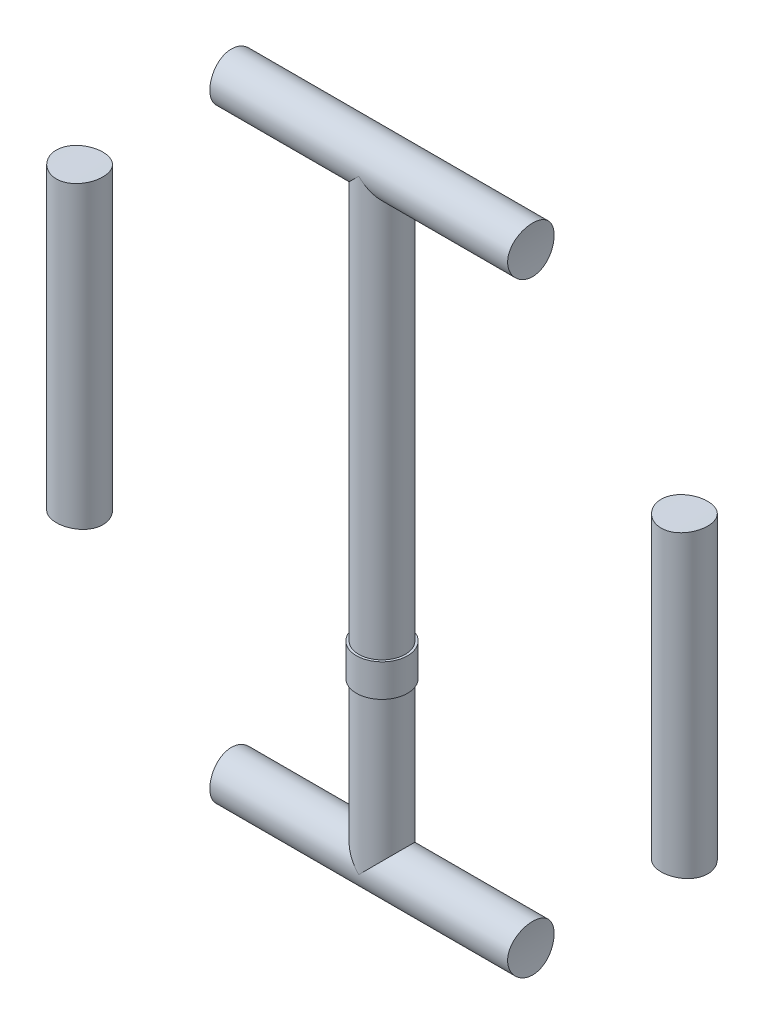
from build123d import *

# Parameters (mm, degrees)
SKETCH2_R                            = 50
BOSS_EXTRUDE1_REACH                  = 993.211
BOSS_EXTRUDE1_END_RADIUS             = 50
SKETCH3_R                            = 50
BOSS_EXTRUDE1_DIRECTION_2_REACH      = 993.211
BOSS_EXTRUDE1_DIRECTION_2_END_RADIUS = 50
CUT_EXTRUDE2_DEPTH                   = 992.21138008
CUT_EXTRUDE2_DEPTH_BACK              = 992.21138008
SKETCH4_R                            = 330
SKETCH5_R                            = 55
BOSS_EXTRUDE2_DEPTH                  = 70


with BuildPart() as part:
    # Sweep1: sweep along a path in Sketch1
    with BuildLine(Plane.XY) as sweep1_path:
        Line((-650, 650), (650, 650))
        Line((650, 650), (650, -650))
        Line((650, -650), (-650, -650))
        Line((-650, -650), (-650, 650))
    # Sketch2 → Sweep1 (sweep)
    with BuildSketch(Plane(origin=(0, 0, 0), x_dir=(0, 0, -1), z_dir=(1, 0, 0))):
        with Locations((0, 650)):
            Circle(SKETCH2_R)
    sweep(path=sweep1_path.line, transition=Transition.RIGHT)

    # Boss-Extrude1: up to this cylinder (the profile starts outside it)
    boss_extrude1_end = Plane(origin=(0, 650, 0), z_dir=(-1, 0, 0)) * Cylinder(BOSS_EXTRUDE1_END_RADIUS, 2087.422, mode=Mode.PRIVATE)
    # Sketch3 → Boss-Extrude1 (add, up to the surface)
    with BuildSketch(Plane(origin=(0, 0, 0), x_dir=(1, 0, 0), z_dir=(0, 1, 0)), mode=Mode.PRIVATE) as boss_extrude1_sk1:
        with Locations(Location((0, 0, 0), (0, 0, 90))):
            Circle(SKETCH3_R)
    boss_extrude1_tool1 = extrude(boss_extrude1_sk1.sketch, amount=BOSS_EXTRUDE1_REACH, mode=Mode.PRIVATE) - boss_extrude1_end
    add(boss_extrude1_tool1.solids().sort_by_distance((0, 0, 0))[0])

    # Boss-Extrude1 direction 2: up to this cylinder (the profile starts outside it)
    boss_extrude1_direction_2_end = Plane(origin=(0, -650, 0), z_dir=(-1, 0, 0)) * Cylinder(BOSS_EXTRUDE1_DIRECTION_2_END_RADIUS, 2087.422, mode=Mode.PRIVATE)
    # Sketch3 → Boss-Extrude1 direction 2 (add, up to the surface)
    with BuildSketch(Plane(origin=(0, 0, 0), x_dir=(1, 0, 0), z_dir=(0, 1, 0)), mode=Mode.PRIVATE) as boss_extrude1_direction_2_sk1:
        with Locations(Location((0, 0, 0), (0, 0, 90))):
            Circle(SKETCH3_R)
    boss_extrude1_direction_2_tool1 = extrude(boss_extrude1_direction_2_sk1.sketch, amount=-BOSS_EXTRUDE1_DIRECTION_2_REACH, mode=Mode.PRIVATE) - boss_extrude1_direction_2_end
    add(boss_extrude1_direction_2_tool1.solids().sort_by_distance((0, 0, 0))[0])

    # Sketch4 → Cut-Extrude2 (cut, two sides: drawn at the far end of the back side and taken through both)
    with BuildSketch(Plane.XY.offset(-CUT_EXTRUDE2_DEPTH_BACK)):
        with Locations((-650, 650)):
            Circle(SKETCH4_R)
        with Locations((-650, -650)):
            Circle(SKETCH4_R)
        with Locations((650, -650)):
            Circle(SKETCH4_R)
        with Locations((650, 650)):
            Circle(SKETCH4_R)
    extrude(amount=CUT_EXTRUDE2_DEPTH + CUT_EXTRUDE2_DEPTH_BACK, mode=Mode.SUBTRACT)


with BuildPart() as cut_extrude2_piece_1:
    # of the separate pieces the step leaves, piece 1, a body of its own (cut_extrude2_pieces)
    add(part.part.solids().sort_by_distance((-320, 650, -50))[0])

    # Sketch5 → Boss-Extrude2 (add)
    with BuildSketch(Plane(origin=(0, -310, 0), x_dir=(1, 0, 0), z_dir=(0, 1, 0))):
        with Locations(Location((0, 0, 0), (0, 0, 270))):
            Circle(SKETCH5_R)
    extrude(amount=BOSS_EXTRUDE2_DEPTH)


with BuildPart() as cut_extrude2_piece_2:
    # of the separate pieces the step leaves, piece 2, a body of its own (cut_extrude2_pieces)
    add(part.part.solids().sort_by_distance((-650, -320, -50))[0])


with BuildPart() as cut_extrude2_piece_3:
    # of the separate pieces the step leaves, piece 3, a body of its own (cut_extrude2_pieces)
    add(part.part.solids().sort_by_distance((650, 320, -50))[0])


solid = Compound([cut_extrude2_piece_1.part, cut_extrude2_piece_2.part, cut_extrude2_piece_3.part])
